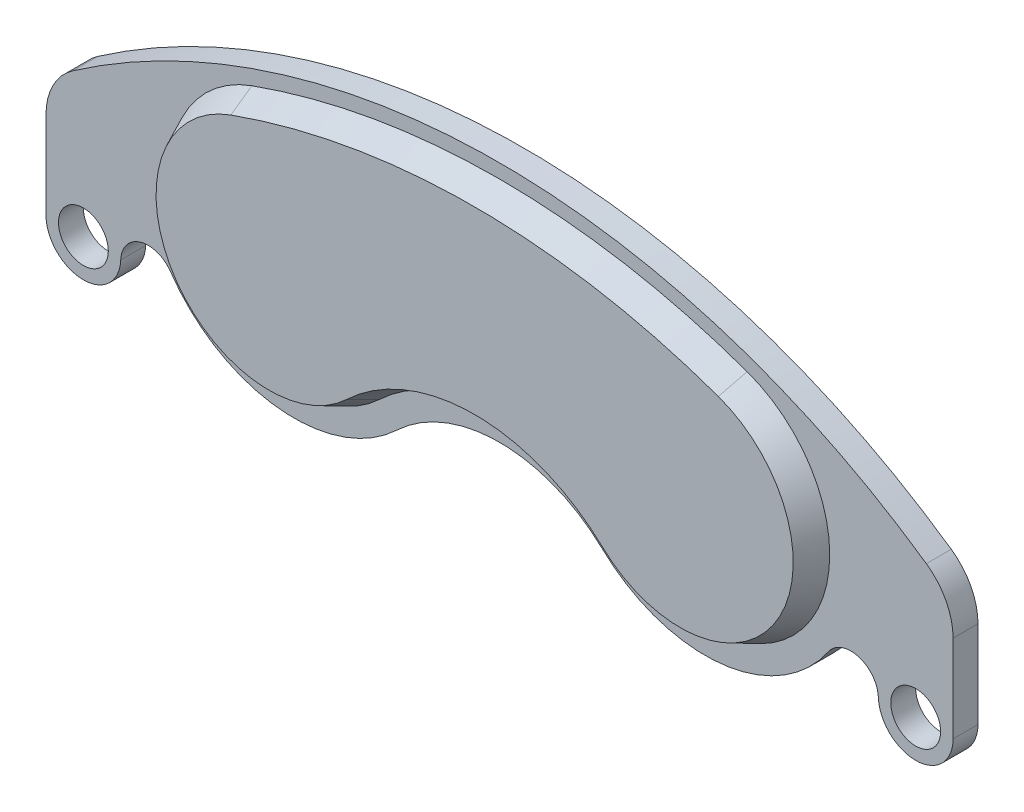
ISO-10303-21;
HEADER;
FILE_DESCRIPTION(('STEP AP214'),'2;1');
FILE_NAME('part.step','',(''),(''),'','','');
FILE_SCHEMA(('AUTOMOTIVE_DESIGN { 1 0 10303 214 1 1 1 1 }'));
ENDSEC;
DATA;
#1=APPLICATION_CONTEXT('core data for automotive mechanical design processes');
#2=APPLICATION_PROTOCOL_DEFINITION('international standard','automotive_design',2000,#1);
#3=PRODUCT_CONTEXT('',#1,'mechanical');
#4=PRODUCT('Part','Part','',(#3));
#5=PRODUCT_RELATED_PRODUCT_CATEGORY('part','',(#4));
#6=PRODUCT_DEFINITION_FORMATION('','',#4);
#7=PRODUCT_DEFINITION_CONTEXT('part definition',#1,'design');
#8=PRODUCT_DEFINITION('design','',#6,#7);
#9=PRODUCT_DEFINITION_SHAPE('','',#8);
#10=(LENGTH_UNIT() NAMED_UNIT(*) SI_UNIT(.MILLI.,.METRE.));
#11=(NAMED_UNIT(*) PLANE_ANGLE_UNIT() SI_UNIT($,.RADIAN.));
#12=(NAMED_UNIT(*) SI_UNIT($,.STERADIAN.) SOLID_ANGLE_UNIT());
#13=UNCERTAINTY_MEASURE_WITH_UNIT(LENGTH_MEASURE(1.E-05),#10,'distance_accuracy_value','');
#14=(GEOMETRIC_REPRESENTATION_CONTEXT(3) GLOBAL_UNCERTAINTY_ASSIGNED_CONTEXT((#13)) GLOBAL_UNIT_ASSIGNED_CONTEXT((#10,
#11,#12)) REPRESENTATION_CONTEXT('',''));
#15=CARTESIAN_POINT('',(0.,0.,0.));
#16=DIRECTION('',(0.,0.,1.));
#17=DIRECTION('',(1.,0.,0.));
#18=AXIS2_PLACEMENT_3D('',#15,#16,#17);
#19=CARTESIAN_POINT('',(-39.878,57.3477777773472,1.27));
#20=DIRECTION('',(0.,0.,1.));
#21=DIRECTION('',(1.,0.,0.));
#22=AXIS2_PLACEMENT_3D('',#19,#20,#21);
#23=PLANE('',#22);
#24=CARTESIAN_POINT('',(42.418,48.4577777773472,1.27));
#25=DIRECTION('',(0.,0.,1.));
#26=DIRECTION('',(1.,0.,0.));
#27=AXIS2_PLACEMENT_3D('',#24,#25,#26);
#28=CIRCLE('',#27,2.54);
#29=CARTESIAN_POINT('',(44.958,48.4577777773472,1.27));
#30=VERTEX_POINT('',#29);
#31=EDGE_CURVE('E299',#30,#30,#28,.T.);
#32=ORIENTED_EDGE('',*,*,#31,.F.);
#33=EDGE_LOOP('',(#32));
#34=FACE_BOUND('',#33,.T.);
#35=CARTESIAN_POINT('',(-42.418,48.4577777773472,1.27));
#36=DIRECTION('',(0.,0.,1.));
#37=DIRECTION('',(1.,0.,0.));
#38=AXIS2_PLACEMENT_3D('',#35,#36,#37);
#39=CIRCLE('',#38,2.54);
#40=CARTESIAN_POINT('',(-39.878,48.4577777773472,1.27));
#41=VERTEX_POINT('',#40);
#42=EDGE_CURVE('E293',#41,#41,#39,.T.);
#43=ORIENTED_EDGE('',*,*,#42,.F.);
#44=EDGE_LOOP('',(#43));
#45=FACE_BOUND('',#44,.T.);
#46=CARTESIAN_POINT('',(-39.878,57.3477777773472,1.27));
#47=DIRECTION('',(0.,0.,1.));
#48=DIRECTION('',(1.,0.,0.));
#49=AXIS2_PLACEMENT_3D('',#46,#47,#48);
#50=CIRCLE('',#49,6.34999999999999);
#51=CARTESIAN_POINT('',(-43.5032727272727,62.5612121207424,1.27));
#52=VERTEX_POINT('',#51);
#53=CARTESIAN_POINT('',(-46.228,57.3477777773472,1.27));
#54=VERTEX_POINT('',#53);
#55=EDGE_CURVE('E188',#52,#54,#50,.T.);
#56=ORIENTED_EDGE('',*,*,#55,.T.);
#57=DIRECTION('',(0.,-1.,0.));
#58=VECTOR('',#57,1.);
#59=CARTESIAN_POINT('',(-46.228,57.3477777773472,1.27));
#60=LINE('',#59,#58);
#61=CARTESIAN_POINT('',(-46.228,48.4577777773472,1.27));
#62=VERTEX_POINT('',#61);
#63=EDGE_CURVE('E109',#54,#62,#60,.T.);
#64=ORIENTED_EDGE('',*,*,#63,.T.);
#65=CARTESIAN_POINT('',(-42.418,48.4577777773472,1.27));
#66=DIRECTION('',(0.,0.,1.));
#67=DIRECTION('',(1.,0.,0.));
#68=AXIS2_PLACEMENT_3D('',#65,#66,#67);
#69=CIRCLE('',#68,3.81);
#70=CARTESIAN_POINT('',(-38.6107361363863,48.3134106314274,1.27));
#71=VERTEX_POINT('',#70);
#72=EDGE_CURVE('E215',#62,#71,#69,.T.);
#73=ORIENTED_EDGE('',*,*,#72,.T.);
#74=CARTESIAN_POINT('',(-35.8187426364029,48.2075413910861,1.27));
#75=DIRECTION('',(0.,0.,-1.));
#76=DIRECTION('',(-1.,0.,0.));
#77=AXIS2_PLACEMENT_3D('',#74,#75,#76);
#78=CIRCLE('',#77,2.794);
#79=CARTESIAN_POINT('',(-33.5159092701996,49.7897532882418,1.27));
#80=VERTEX_POINT('',#79);
#81=EDGE_CURVE('E233',#71,#80,#78,.T.);
#82=ORIENTED_EDGE('',*,*,#81,.T.);
#83=CARTESIAN_POINT('',(-20.955,58.42,1.27));
#84=DIRECTION('',(0.,0.,1.));
#85=DIRECTION('',(1.,0.,0.));
#86=AXIS2_PLACEMENT_3D('',#83,#84,#85);
#87=CIRCLE('',#86,15.24);
#88=CARTESIAN_POINT('',(-10.4775,47.3529500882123,1.27));
#89=VERTEX_POINT('',#88);
#90=EDGE_CURVE('E230',#80,#89,#87,.T.);
#91=ORIENTED_EDGE('',*,*,#90,.T.);
#92=CARTESIAN_POINT('',(0.,36.2859001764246,1.27));
#93=DIRECTION('',(0.,0.,-1.));
#94=DIRECTION('',(-1.,0.,0.));
#95=AXIS2_PLACEMENT_3D('',#92,#93,#94);
#96=CIRCLE('',#95,15.24);
#97=CARTESIAN_POINT('',(10.4775,47.3529500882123,1.27));
#98=VERTEX_POINT('',#97);
#99=EDGE_CURVE('E232',#89,#98,#96,.T.);
#100=ORIENTED_EDGE('',*,*,#99,.T.);
#101=CARTESIAN_POINT('',(20.955,58.42,1.27));
#102=DIRECTION('',(0.,0.,1.));
#103=DIRECTION('',(1.,0.,0.));
#104=AXIS2_PLACEMENT_3D('',#101,#102,#103);
#105=CIRCLE('',#104,15.24);
#106=CARTESIAN_POINT('',(33.5159092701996,49.7897532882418,1.27));
#107=VERTEX_POINT('',#106);
#108=EDGE_CURVE('E235',#98,#107,#105,.T.);
#109=ORIENTED_EDGE('',*,*,#108,.T.);
#110=CARTESIAN_POINT('',(35.8187426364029,48.2075413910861,1.27));
#111=DIRECTION('',(0.,0.,-1.));
#112=DIRECTION('',(-1.,0.,0.));
#113=AXIS2_PLACEMENT_3D('',#110,#111,#112);
#114=CIRCLE('',#113,2.794);
#115=CARTESIAN_POINT('',(38.6107361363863,48.3134106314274,1.27));
#116=VERTEX_POINT('',#115);
#117=EDGE_CURVE('E241',#107,#116,#114,.T.);
#118=ORIENTED_EDGE('',*,*,#117,.T.);
#119=CARTESIAN_POINT('',(42.418,48.4577777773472,1.27));
#120=DIRECTION('',(0.,0.,1.));
#121=DIRECTION('',(1.,0.,0.));
#122=AXIS2_PLACEMENT_3D('',#119,#120,#121);
#123=CIRCLE('',#122,3.81);
#124=CARTESIAN_POINT('',(46.228,48.4577777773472,1.27));
#125=VERTEX_POINT('',#124);
#126=EDGE_CURVE('E143',#116,#125,#123,.T.);
#127=ORIENTED_EDGE('',*,*,#126,.T.);
#128=DIRECTION('',(0.,1.,0.));
#129=VECTOR('',#128,1.);
#130=CARTESIAN_POINT('',(46.228,57.3477777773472,1.27));
#131=LINE('',#130,#129);
#132=CARTESIAN_POINT('',(46.228,57.3477777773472,1.27));
#133=VERTEX_POINT('',#132);
#134=EDGE_CURVE('E136',#125,#133,#131,.T.);
#135=ORIENTED_EDGE('',*,*,#134,.T.);
#136=CARTESIAN_POINT('',(39.878,57.3477777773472,1.27));
#137=DIRECTION('',(0.,0.,1.));
#138=DIRECTION('',(-1.,0.,0.));
#139=AXIS2_PLACEMENT_3D('',#136,#137,#138);
#140=CIRCLE('',#139,6.34999999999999);
#141=CARTESIAN_POINT('',(43.5032727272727,62.5612121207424,1.27));
#142=VERTEX_POINT('',#141);
#143=EDGE_CURVE('E140',#133,#142,#140,.T.);
#144=ORIENTED_EDGE('',*,*,#143,.T.);
#145=CARTESIAN_POINT('',(0.,0.,1.27));
#146=DIRECTION('',(0.,0.,1.));
#147=DIRECTION('',(-1.,0.,0.));
#148=AXIS2_PLACEMENT_3D('',#145,#146,#147);
#149=CIRCLE('',#148,76.2);
#150=EDGE_CURVE('E56',#142,#52,#149,.T.);
#151=ORIENTED_EDGE('',*,*,#150,.T.);
#152=EDGE_LOOP('',(#56,#64,#73,#82,#91,#100,#109,#118,#127,#135,#144,#151));
#153=FACE_BOUND('',#152,.T.);
#154=CARTESIAN_POINT('',(0.,36.2859001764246,1.27));
#155=DIRECTION('',(0.,0.,-1.));
#156=DIRECTION('',(-1.,0.,0.));
#157=AXIS2_PLACEMENT_3D('',#154,#155,#156);
#158=CIRCLE('',#157,17.78);
#159=CARTESIAN_POINT('',(-12.22375,49.1974584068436,1.27));
#160=VERTEX_POINT('',#159);
#161=CARTESIAN_POINT('',(12.22375,49.1974584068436,1.27));
#162=VERTEX_POINT('',#161);
#163=EDGE_CURVE('E284',#160,#162,#158,.T.);
#164=ORIENTED_EDGE('',*,*,#163,.F.);
#165=CARTESIAN_POINT('',(-20.955,58.42,1.27));
#166=DIRECTION('',(0.,0.,1.));
#167=DIRECTION('',(1.,0.,0.));
#168=AXIS2_PLACEMENT_3D('',#165,#166,#167);
#169=CIRCLE('',#168,12.7);
#170=CARTESIAN_POINT('',(-25.2429308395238,70.3742314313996,1.27));
#171=VERTEX_POINT('',#170);
#172=EDGE_CURVE('E287',#171,#160,#169,.T.);
#173=ORIENTED_EDGE('',*,*,#172,.F.);
#174=CARTESIAN_POINT('',(0.,0.,1.27));
#175=DIRECTION('',(0.,0.,1.));
#176=DIRECTION('',(-1.,0.,0.));
#177=AXIS2_PLACEMENT_3D('',#174,#175,#176);
#178=CIRCLE('',#177,74.7645504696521);
#179=CARTESIAN_POINT('',(25.2429308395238,70.3742314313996,1.27));
#180=VERTEX_POINT('',#179);
#181=EDGE_CURVE('E272',#180,#171,#178,.T.);
#182=ORIENTED_EDGE('',*,*,#181,.F.);
#183=CARTESIAN_POINT('',(20.955,58.42,1.27));
#184=DIRECTION('',(0.,0.,1.));
#185=DIRECTION('',(1.,0.,0.));
#186=AXIS2_PLACEMENT_3D('',#183,#184,#185);
#187=CIRCLE('',#186,12.7);
#188=EDGE_CURVE('E282',#162,#180,#187,.T.);
#189=ORIENTED_EDGE('',*,*,#188,.F.);
#190=EDGE_LOOP('',(#164,#173,#182,#189));
#191=FACE_BOUND('',#190,.T.);
#192=ADVANCED_FACE('F32',(#34,#45,#153,#191),#23,.T.);
#193=CARTESIAN_POINT('',(-39.878,57.3477777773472,1.27));
#194=DIRECTION('',(0.,0.,-1.));
#195=DIRECTION('',(-1.,0.,0.));
#196=AXIS2_PLACEMENT_3D('',#193,#194,#195);
#197=CYLINDRICAL_SURFACE('',#196,6.34999999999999);
#198=CARTESIAN_POINT('',(-39.878,57.3477777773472,-1.27));
#199=DIRECTION('',(0.,0.,1.));
#200=DIRECTION('',(1.,0.,0.));
#201=AXIS2_PLACEMENT_3D('',#198,#199,#200);
#202=CIRCLE('',#201,6.34999999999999);
#203=CARTESIAN_POINT('',(-43.5032727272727,62.5612121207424,-1.27));
#204=VERTEX_POINT('',#203);
#205=CARTESIAN_POINT('',(-46.228,57.3477777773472,-1.27));
#206=VERTEX_POINT('',#205);
#207=EDGE_CURVE('E164',#204,#206,#202,.T.);
#208=ORIENTED_EDGE('',*,*,#207,.T.);
#209=DIRECTION('',(0.,0.,-1.));
#210=VECTOR('',#209,1.);
#211=CARTESIAN_POINT('',(-46.228,57.3477777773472,1.27));
#212=LINE('',#211,#210);
#213=EDGE_CURVE('E11',#54,#206,#212,.T.);
#214=ORIENTED_EDGE('',*,*,#213,.F.);
#215=ORIENTED_EDGE('',*,*,#55,.F.);
#216=DIRECTION('',(0.,0.,-1.));
#217=VECTOR('',#216,1.);
#218=CARTESIAN_POINT('',(-43.5032727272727,62.5612121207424,1.27));
#219=LINE('',#218,#217);
#220=EDGE_CURVE('E160',#52,#204,#219,.T.);
#221=ORIENTED_EDGE('',*,*,#220,.T.);
#222=EDGE_LOOP('',(#208,#214,#215,#221));
#223=FACE_BOUND('',#222,.T.);
#224=ADVANCED_FACE('F34',(#223),#197,.T.);
#225=CARTESIAN_POINT('',(-46.228,57.3477777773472,1.27));
#226=DIRECTION('',(1.,0.,0.));
#227=DIRECTION('',(0.,0.,-1.));
#228=AXIS2_PLACEMENT_3D('',#225,#226,#227);
#229=PLANE('',#228);
#230=DIRECTION('',(0.,-1.,0.));
#231=VECTOR('',#230,1.);
#232=CARTESIAN_POINT('',(-46.228,57.3477777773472,-1.27));
#233=LINE('',#232,#231);
#234=CARTESIAN_POINT('',(-46.228,48.4577777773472,-1.27));
#235=VERTEX_POINT('',#234);
#236=EDGE_CURVE('E167',#206,#235,#233,.T.);
#237=ORIENTED_EDGE('',*,*,#236,.T.);
#238=DIRECTION('',(0.,0.,-1.));
#239=VECTOR('',#238,1.);
#240=CARTESIAN_POINT('',(-46.228,48.4577777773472,1.27));
#241=LINE('',#240,#239);
#242=EDGE_CURVE('E40',#62,#235,#241,.T.);
#243=ORIENTED_EDGE('',*,*,#242,.F.);
#244=ORIENTED_EDGE('',*,*,#63,.F.);
#245=ORIENTED_EDGE('',*,*,#213,.T.);
#246=EDGE_LOOP('',(#237,#243,#244,#245));
#247=FACE_BOUND('',#246,.T.);
#248=ADVANCED_FACE('F354',(#247),#229,.F.);
#249=CARTESIAN_POINT('',(-42.418,48.4577777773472,1.27));
#250=DIRECTION('',(0.,0.,-1.));
#251=DIRECTION('',(-1.,0.,0.));
#252=AXIS2_PLACEMENT_3D('',#249,#250,#251);
#253=CYLINDRICAL_SURFACE('',#252,3.81);
#254=CARTESIAN_POINT('',(-42.418,48.4577777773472,-1.27));
#255=DIRECTION('',(0.,0.,1.));
#256=DIRECTION('',(1.,0.,0.));
#257=AXIS2_PLACEMENT_3D('',#254,#255,#256);
#258=CIRCLE('',#257,3.81);
#259=CARTESIAN_POINT('',(-38.6107361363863,48.3134106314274,-1.27));
#260=VERTEX_POINT('',#259);
#261=EDGE_CURVE('E170',#235,#260,#258,.T.);
#262=ORIENTED_EDGE('',*,*,#261,.T.);
#263=DIRECTION('',(0.,0.,-1.));
#264=VECTOR('',#263,1.);
#265=CARTESIAN_POINT('',(-38.6107361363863,48.3134106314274,1.27));
#266=LINE('',#265,#264);
#267=EDGE_CURVE('E207',#71,#260,#266,.T.);
#268=ORIENTED_EDGE('',*,*,#267,.F.);
#269=ORIENTED_EDGE('',*,*,#72,.F.);
#270=ORIENTED_EDGE('',*,*,#242,.T.);
#271=EDGE_LOOP('',(#262,#268,#269,#270));
#272=FACE_BOUND('',#271,.T.);
#273=ADVANCED_FACE('F213',(#272),#253,.T.);
#274=CARTESIAN_POINT('',(-35.8187426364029,48.2075413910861,1.27));
#275=DIRECTION('',(0.,0.,-1.));
#276=DIRECTION('',(-1.,0.,0.));
#277=AXIS2_PLACEMENT_3D('',#274,#275,#276);
#278=CYLINDRICAL_SURFACE('',#277,2.794);
#279=CARTESIAN_POINT('',(-35.8187426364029,48.2075413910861,-1.27));
#280=DIRECTION('',(0.,0.,-1.));
#281=DIRECTION('',(-1.,0.,0.));
#282=AXIS2_PLACEMENT_3D('',#279,#280,#281);
#283=CIRCLE('',#282,2.794);
#284=CARTESIAN_POINT('',(-33.5159092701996,49.7897532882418,-1.27));
#285=VERTEX_POINT('',#284);
#286=EDGE_CURVE('E172',#260,#285,#283,.T.);
#287=ORIENTED_EDGE('',*,*,#286,.T.);
#288=DIRECTION('',(0.,0.,-1.));
#289=VECTOR('',#288,1.);
#290=CARTESIAN_POINT('',(-33.5159092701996,49.7897532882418,1.27));
#291=LINE('',#290,#289);
#292=EDGE_CURVE('E204',#80,#285,#291,.T.);
#293=ORIENTED_EDGE('',*,*,#292,.F.);
#294=ORIENTED_EDGE('',*,*,#81,.F.);
#295=ORIENTED_EDGE('',*,*,#267,.T.);
#296=EDGE_LOOP('',(#287,#293,#294,#295));
#297=FACE_BOUND('',#296,.T.);
#298=ADVANCED_FACE('F224',(#297),#278,.F.);
#299=CARTESIAN_POINT('',(-20.955,58.42,1.27));
#300=DIRECTION('',(0.,0.,-1.));
#301=DIRECTION('',(-1.,0.,0.));
#302=AXIS2_PLACEMENT_3D('',#299,#300,#301);
#303=CYLINDRICAL_SURFACE('',#302,15.24);
#304=CARTESIAN_POINT('',(-20.955,58.42,-1.27));
#305=DIRECTION('',(0.,0.,1.));
#306=DIRECTION('',(1.,0.,0.));
#307=AXIS2_PLACEMENT_3D('',#304,#305,#306);
#308=CIRCLE('',#307,15.24);
#309=CARTESIAN_POINT('',(-10.4775,47.3529500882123,-1.27));
#310=VERTEX_POINT('',#309);
#311=EDGE_CURVE('E174',#285,#310,#308,.T.);
#312=ORIENTED_EDGE('',*,*,#311,.T.);
#313=DIRECTION('',(0.,0.,-1.));
#314=VECTOR('',#313,1.);
#315=CARTESIAN_POINT('',(-10.4775,47.3529500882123,1.27));
#316=LINE('',#315,#314);
#317=EDGE_CURVE('E201',#89,#310,#316,.T.);
#318=ORIENTED_EDGE('',*,*,#317,.F.);
#319=ORIENTED_EDGE('',*,*,#90,.F.);
#320=ORIENTED_EDGE('',*,*,#292,.T.);
#321=EDGE_LOOP('',(#312,#318,#319,#320));
#322=FACE_BOUND('',#321,.T.);
#323=ADVANCED_FACE('F228',(#322),#303,.T.);
#324=CARTESIAN_POINT('',(0.,36.2859001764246,1.27));
#325=DIRECTION('',(0.,0.,-1.));
#326=DIRECTION('',(-1.,0.,0.));
#327=AXIS2_PLACEMENT_3D('',#324,#325,#326);
#328=CYLINDRICAL_SURFACE('',#327,15.24);
#329=CARTESIAN_POINT('',(0.,36.2859001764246,-1.27));
#330=DIRECTION('',(0.,0.,-1.));
#331=DIRECTION('',(-1.,0.,0.));
#332=AXIS2_PLACEMENT_3D('',#329,#330,#331);
#333=CIRCLE('',#332,15.24);
#334=CARTESIAN_POINT('',(10.4775,47.3529500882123,-1.27));
#335=VERTEX_POINT('',#334);
#336=EDGE_CURVE('E176',#310,#335,#333,.T.);
#337=ORIENTED_EDGE('',*,*,#336,.T.);
#338=DIRECTION('',(0.,0.,-1.));
#339=VECTOR('',#338,1.);
#340=CARTESIAN_POINT('',(10.4775,47.3529500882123,1.27));
#341=LINE('',#340,#339);
#342=EDGE_CURVE('E198',#98,#335,#341,.T.);
#343=ORIENTED_EDGE('',*,*,#342,.F.);
#344=ORIENTED_EDGE('',*,*,#99,.F.);
#345=ORIENTED_EDGE('',*,*,#317,.T.);
#346=EDGE_LOOP('',(#337,#343,#344,#345));
#347=FACE_BOUND('',#346,.T.);
#348=ADVANCED_FACE('F344',(#347),#328,.F.);
#349=CARTESIAN_POINT('',(20.955,58.42,1.27));
#350=DIRECTION('',(0.,0.,-1.));
#351=DIRECTION('',(-1.,0.,0.));
#352=AXIS2_PLACEMENT_3D('',#349,#350,#351);
#353=CYLINDRICAL_SURFACE('',#352,15.24);
#354=CARTESIAN_POINT('',(20.955,58.42,-1.27));
#355=DIRECTION('',(0.,0.,1.));
#356=DIRECTION('',(1.,0.,0.));
#357=AXIS2_PLACEMENT_3D('',#354,#355,#356);
#358=CIRCLE('',#357,15.24);
#359=CARTESIAN_POINT('',(33.5159092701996,49.7897532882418,-1.27));
#360=VERTEX_POINT('',#359);
#361=EDGE_CURVE('E178',#335,#360,#358,.T.);
#362=ORIENTED_EDGE('',*,*,#361,.T.);
#363=DIRECTION('',(0.,0.,-1.));
#364=VECTOR('',#363,1.);
#365=CARTESIAN_POINT('',(33.5159092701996,49.7897532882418,1.27));
#366=LINE('',#365,#364);
#367=EDGE_CURVE('E195',#107,#360,#366,.T.);
#368=ORIENTED_EDGE('',*,*,#367,.F.);
#369=ORIENTED_EDGE('',*,*,#108,.F.);
#370=ORIENTED_EDGE('',*,*,#342,.T.);
#371=EDGE_LOOP('',(#362,#368,#369,#370));
#372=FACE_BOUND('',#371,.T.);
#373=ADVANCED_FACE('F341',(#372),#353,.T.);
#374=CARTESIAN_POINT('',(35.8187426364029,48.2075413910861,1.27));
#375=DIRECTION('',(0.,0.,-1.));
#376=DIRECTION('',(-1.,0.,0.));
#377=AXIS2_PLACEMENT_3D('',#374,#375,#376);
#378=CYLINDRICAL_SURFACE('',#377,2.794);
#379=CARTESIAN_POINT('',(35.8187426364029,48.2075413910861,-1.27));
#380=DIRECTION('',(0.,0.,-1.));
#381=DIRECTION('',(-1.,0.,0.));
#382=AXIS2_PLACEMENT_3D('',#379,#380,#381);
#383=CIRCLE('',#382,2.794);
#384=CARTESIAN_POINT('',(38.6107361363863,48.3134106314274,-1.27));
#385=VERTEX_POINT('',#384);
#386=EDGE_CURVE('E180',#360,#385,#383,.T.);
#387=ORIENTED_EDGE('',*,*,#386,.T.);
#388=DIRECTION('',(0.,0.,-1.));
#389=VECTOR('',#388,1.);
#390=CARTESIAN_POINT('',(38.6107361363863,48.3134106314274,1.27));
#391=LINE('',#390,#389);
#392=EDGE_CURVE('E192',#116,#385,#391,.T.);
#393=ORIENTED_EDGE('',*,*,#392,.F.);
#394=ORIENTED_EDGE('',*,*,#117,.F.);
#395=ORIENTED_EDGE('',*,*,#367,.T.);
#396=EDGE_LOOP('',(#387,#393,#394,#395));
#397=FACE_BOUND('',#396,.T.);
#398=ADVANCED_FACE('F247',(#397),#378,.F.);
#399=CARTESIAN_POINT('',(42.418,48.4577777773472,1.27));
#400=DIRECTION('',(0.,0.,-1.));
#401=DIRECTION('',(-1.,0.,0.));
#402=AXIS2_PLACEMENT_3D('',#399,#400,#401);
#403=CYLINDRICAL_SURFACE('',#402,3.81);
#404=CARTESIAN_POINT('',(42.418,48.4577777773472,-1.27));
#405=DIRECTION('',(0.,0.,1.));
#406=DIRECTION('',(1.,0.,0.));
#407=AXIS2_PLACEMENT_3D('',#404,#405,#406);
#408=CIRCLE('',#407,3.81);
#409=CARTESIAN_POINT('',(46.228,48.4577777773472,-1.27));
#410=VERTEX_POINT('',#409);
#411=EDGE_CURVE('E182',#385,#410,#408,.T.);
#412=ORIENTED_EDGE('',*,*,#411,.T.);
#413=DIRECTION('',(0.,0.,-1.));
#414=VECTOR('',#413,1.);
#415=CARTESIAN_POINT('',(46.228,48.4577777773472,1.27));
#416=LINE('',#415,#414);
#417=EDGE_CURVE('E155',#125,#410,#416,.T.);
#418=ORIENTED_EDGE('',*,*,#417,.F.);
#419=ORIENTED_EDGE('',*,*,#126,.F.);
#420=ORIENTED_EDGE('',*,*,#392,.T.);
#421=EDGE_LOOP('',(#412,#418,#419,#420));
#422=FACE_BOUND('',#421,.T.);
#423=ADVANCED_FACE('F251',(#422),#403,.T.);
#424=CARTESIAN_POINT('',(46.228,57.3477777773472,1.27));
#425=DIRECTION('',(-1.,0.,0.));
#426=DIRECTION('',(0.,0.,1.));
#427=AXIS2_PLACEMENT_3D('',#424,#425,#426);
#428=PLANE('',#427);
#429=DIRECTION('',(0.,1.,0.));
#430=VECTOR('',#429,1.);
#431=CARTESIAN_POINT('',(46.228,57.3477777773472,-1.27));
#432=LINE('',#431,#430);
#433=CARTESIAN_POINT('',(46.228,57.3477777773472,-1.27));
#434=VERTEX_POINT('',#433);
#435=EDGE_CURVE('E152',#410,#434,#432,.T.);
#436=ORIENTED_EDGE('',*,*,#435,.T.);
#437=DIRECTION('',(0.,0.,-1.));
#438=VECTOR('',#437,1.);
#439=CARTESIAN_POINT('',(46.228,57.3477777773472,1.27));
#440=LINE('',#439,#438);
#441=EDGE_CURVE('E149',#133,#434,#440,.T.);
#442=ORIENTED_EDGE('',*,*,#441,.F.);
#443=ORIENTED_EDGE('',*,*,#134,.F.);
#444=ORIENTED_EDGE('',*,*,#417,.T.);
#445=EDGE_LOOP('',(#436,#442,#443,#444));
#446=FACE_BOUND('',#445,.T.);
#447=ADVANCED_FACE('F150',(#446),#428,.F.);
#448=CARTESIAN_POINT('',(39.878,57.3477777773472,1.27));
#449=DIRECTION('',(0.,0.,-1.));
#450=DIRECTION('',(-1.,0.,0.));
#451=AXIS2_PLACEMENT_3D('',#448,#449,#450);
#452=CYLINDRICAL_SURFACE('',#451,6.34999999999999);
#453=CARTESIAN_POINT('',(39.878,57.3477777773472,-1.27));
#454=DIRECTION('',(0.,0.,1.));
#455=DIRECTION('',(-1.,0.,0.));
#456=AXIS2_PLACEMENT_3D('',#453,#454,#455);
#457=CIRCLE('',#456,6.34999999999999);
#458=CARTESIAN_POINT('',(43.5032727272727,62.5612121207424,-1.27));
#459=VERTEX_POINT('',#458);
#460=EDGE_CURVE('E185',#434,#459,#457,.T.);
#461=ORIENTED_EDGE('',*,*,#460,.T.);
#462=DIRECTION('',(0.,0.,-1.));
#463=VECTOR('',#462,1.);
#464=CARTESIAN_POINT('',(43.5032727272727,62.5612121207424,1.27));
#465=LINE('',#464,#463);
#466=EDGE_CURVE('E156',#142,#459,#465,.T.);
#467=ORIENTED_EDGE('',*,*,#466,.F.);
#468=ORIENTED_EDGE('',*,*,#143,.F.);
#469=ORIENTED_EDGE('',*,*,#441,.T.);
#470=EDGE_LOOP('',(#461,#467,#468,#469));
#471=FACE_BOUND('',#470,.T.);
#472=ADVANCED_FACE('F158',(#471),#452,.T.);
#473=CARTESIAN_POINT('',(0.,0.,1.27));
#474=DIRECTION('',(0.,0.,-1.));
#475=DIRECTION('',(-1.,0.,0.));
#476=AXIS2_PLACEMENT_3D('',#473,#474,#475);
#477=CYLINDRICAL_SURFACE('',#476,76.2);
#478=CARTESIAN_POINT('',(0.,0.,-1.27));
#479=DIRECTION('',(0.,0.,1.));
#480=DIRECTION('',(-1.,0.,0.));
#481=AXIS2_PLACEMENT_3D('',#478,#479,#480);
#482=CIRCLE('',#481,76.2);
#483=EDGE_CURVE('E101',#459,#204,#482,.T.);
#484=ORIENTED_EDGE('',*,*,#483,.T.);
#485=ORIENTED_EDGE('',*,*,#220,.F.);
#486=ORIENTED_EDGE('',*,*,#150,.F.);
#487=ORIENTED_EDGE('',*,*,#466,.T.);
#488=EDGE_LOOP('',(#484,#485,#486,#487));
#489=FACE_BOUND('',#488,.T.);
#490=ADVANCED_FACE('F252',(#489),#477,.T.);
#491=CARTESIAN_POINT('',(-39.878,57.3477777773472,-1.27));
#492=DIRECTION('',(0.,0.,1.));
#493=DIRECTION('',(1.,0.,0.));
#494=AXIS2_PLACEMENT_3D('',#491,#492,#493);
#495=PLANE('',#494);
#496=CARTESIAN_POINT('',(42.418,48.4577777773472,-1.27));
#497=DIRECTION('',(0.,0.,1.));
#498=DIRECTION('',(1.,0.,0.));
#499=AXIS2_PLACEMENT_3D('',#496,#497,#498);
#500=CIRCLE('',#499,2.54);
#501=CARTESIAN_POINT('',(44.958,48.4577777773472,-1.27));
#502=VERTEX_POINT('',#501);
#503=EDGE_CURVE('E296',#502,#502,#500,.F.);
#504=ORIENTED_EDGE('',*,*,#503,.F.);
#505=EDGE_LOOP('',(#504));
#506=FACE_BOUND('',#505,.T.);
#507=CARTESIAN_POINT('',(-42.418,48.4577777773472,-1.27));
#508=DIRECTION('',(0.,0.,1.));
#509=DIRECTION('',(1.,0.,0.));
#510=AXIS2_PLACEMENT_3D('',#507,#508,#509);
#511=CIRCLE('',#510,2.54);
#512=CARTESIAN_POINT('',(-39.878,48.4577777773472,-1.27));
#513=VERTEX_POINT('',#512);
#514=EDGE_CURVE('E290',#513,#513,#511,.F.);
#515=ORIENTED_EDGE('',*,*,#514,.F.);
#516=EDGE_LOOP('',(#515));
#517=FACE_BOUND('',#516,.T.);
#518=ORIENTED_EDGE('',*,*,#207,.F.);
#519=ORIENTED_EDGE('',*,*,#483,.F.);
#520=ORIENTED_EDGE('',*,*,#460,.F.);
#521=ORIENTED_EDGE('',*,*,#435,.F.);
#522=ORIENTED_EDGE('',*,*,#411,.F.);
#523=ORIENTED_EDGE('',*,*,#386,.F.);
#524=ORIENTED_EDGE('',*,*,#361,.F.);
#525=ORIENTED_EDGE('',*,*,#336,.F.);
#526=ORIENTED_EDGE('',*,*,#311,.F.);
#527=ORIENTED_EDGE('',*,*,#286,.F.);
#528=ORIENTED_EDGE('',*,*,#261,.F.);
#529=ORIENTED_EDGE('',*,*,#236,.F.);
#530=EDGE_LOOP('',(#518,#519,#520,#521,#522,#523,#524,#525,#526,#527,#528,#529));
#531=FACE_BOUND('',#530,.T.);
#532=ADVANCED_FACE('F219',(#506,#517,#531),#495,.F.);
#533=CARTESIAN_POINT('',(-20.955,58.42,1.27));
#534=DIRECTION('',(0.,0.,-1.));
#535=DIRECTION('',(1.,0.,0.));
#536=AXIS2_PLACEMENT_3D('',#533,#534,#535);
#537=CONICAL_SURFACE('',#536,12.7,0.436332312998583);
#538=ORIENTED_EDGE('',*,*,#172,.T.);
#539=DIRECTION('',(0.290550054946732,-0.306898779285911,-0.90630778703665));
#540=VECTOR('',#539,1.);
#541=CARTESIAN_POINT('',(-12.22375,49.1974584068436,1.27));
#542=LINE('',#541,#540);
#543=CARTESIAN_POINT('',(-13.0380397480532,50.0575667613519,3.81));
#544=VERTEX_POINT('',#543);
#545=EDGE_CURVE('E168',#544,#160,#542,.T.);
#546=ORIENTED_EDGE('',*,*,#545,.F.);
#547=CARTESIAN_POINT('',(-20.955,58.42,3.81));
#548=DIRECTION('',(0.,0.,1.));
#549=DIRECTION('',(1.,0.,0.));
#550=AXIS2_PLACEMENT_3D('',#547,#548,#549);
#551=CIRCLE('',#550,11.5155785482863);
#552=CARTESIAN_POINT('',(-24.843031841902,69.2593614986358,3.81));
#553=VERTEX_POINT('',#552);
#554=EDGE_CURVE('E269',#553,#544,#551,.T.);
#555=ORIENTED_EDGE('',*,*,#554,.F.);
#556=DIRECTION('',(-0.142689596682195,0.39780129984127,-0.90630778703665));
#557=VECTOR('',#556,1.);
#558=CARTESIAN_POINT('',(-25.2429308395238,70.3742314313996,1.27));
#559=LINE('',#558,#557);
#560=EDGE_CURVE('E262',#553,#171,#559,.T.);
#561=ORIENTED_EDGE('',*,*,#560,.T.);
#562=EDGE_LOOP('',(#538,#546,#555,#561));
#563=FACE_BOUND('',#562,.T.);
#564=ADVANCED_FACE('F319',(#563),#537,.T.);
#565=CARTESIAN_POINT('',(0.,36.2859001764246,1.27));
#566=DIRECTION('',(0.,0.,1.));
#567=DIRECTION('',(-1.,0.,0.));
#568=AXIS2_PLACEMENT_3D('',#565,#566,#567);
#569=CONICAL_SURFACE('',#568,17.78,0.436332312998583);
#570=ORIENTED_EDGE('',*,*,#163,.T.);
#571=DIRECTION('',(-0.290550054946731,-0.306898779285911,-0.90630778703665));
#572=VECTOR('',#571,1.);
#573=CARTESIAN_POINT('',(12.22375,49.1974584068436,1.27));
#574=LINE('',#573,#572);
#575=CARTESIAN_POINT('',(13.0380397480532,50.0575667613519,3.81));
#576=VERTEX_POINT('',#575);
#577=EDGE_CURVE('E273',#576,#162,#574,.T.);
#578=ORIENTED_EDGE('',*,*,#577,.F.);
#579=CARTESIAN_POINT('',(0.,36.2859001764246,3.81));
#580=DIRECTION('',(0.,0.,1.));
#581=DIRECTION('',(1.,0.,0.));
#582=AXIS2_PLACEMENT_3D('',#579,#580,#581);
#583=CIRCLE('',#582,18.9644214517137);
#584=EDGE_CURVE('E266',#544,#576,#583,.F.);
#585=ORIENTED_EDGE('',*,*,#584,.F.);
#586=ORIENTED_EDGE('',*,*,#545,.T.);
#587=EDGE_LOOP('',(#570,#578,#585,#586));
#588=FACE_BOUND('',#587,.T.);
#589=ADVANCED_FACE('F326',(#588),#569,.F.);
#590=CARTESIAN_POINT('',(20.955,58.42,1.27));
#591=DIRECTION('',(0.,0.,-1.));
#592=DIRECTION('',(1.,0.,0.));
#593=AXIS2_PLACEMENT_3D('',#590,#591,#592);
#594=CONICAL_SURFACE('',#593,12.7,0.436332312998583);
#595=ORIENTED_EDGE('',*,*,#188,.T.);
#596=DIRECTION('',(0.142689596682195,0.39780129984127,-0.90630778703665));
#597=VECTOR('',#596,1.);
#598=CARTESIAN_POINT('',(25.2429308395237,70.3742314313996,1.27));
#599=LINE('',#598,#597);
#600=CARTESIAN_POINT('',(24.843031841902,69.2593614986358,3.81));
#601=VERTEX_POINT('',#600);
#602=EDGE_CURVE('E47',#601,#180,#599,.T.);
#603=ORIENTED_EDGE('',*,*,#602,.F.);
#604=CARTESIAN_POINT('',(20.955,58.42,3.81));
#605=DIRECTION('',(0.,0.,1.));
#606=DIRECTION('',(1.,0.,0.));
#607=AXIS2_PLACEMENT_3D('',#604,#605,#606);
#608=CIRCLE('',#607,11.5155785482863);
#609=EDGE_CURVE('E263',#576,#601,#608,.T.);
#610=ORIENTED_EDGE('',*,*,#609,.F.);
#611=ORIENTED_EDGE('',*,*,#577,.T.);
#612=EDGE_LOOP('',(#595,#603,#610,#611));
#613=FACE_BOUND('',#612,.T.);
#614=ADVANCED_FACE('F400',(#613),#594,.T.);
#615=CARTESIAN_POINT('',(0.,0.,1.27));
#616=DIRECTION('',(0.,0.,-1.));
#617=DIRECTION('',(-1.,0.,0.));
#618=AXIS2_PLACEMENT_3D('',#615,#616,#617);
#619=CONICAL_SURFACE('',#618,74.7645504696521,0.436332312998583);
#620=ORIENTED_EDGE('',*,*,#181,.T.);
#621=ORIENTED_EDGE('',*,*,#560,.F.);
#622=CARTESIAN_POINT('',(0.,0.,3.81));
#623=DIRECTION('',(0.,0.,1.));
#624=DIRECTION('',(1.,0.,0.));
#625=AXIS2_PLACEMENT_3D('',#622,#623,#624);
#626=CIRCLE('',#625,73.5801290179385);
#627=EDGE_CURVE('E259',#601,#553,#626,.T.);
#628=ORIENTED_EDGE('',*,*,#627,.F.);
#629=ORIENTED_EDGE('',*,*,#602,.T.);
#630=EDGE_LOOP('',(#620,#621,#628,#629));
#631=FACE_BOUND('',#630,.T.);
#632=ADVANCED_FACE('F395',(#631),#619,.T.);
#633=CARTESIAN_POINT('',(-10.4775,47.3529500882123,3.81));
#634=DIRECTION('',(0.,0.,1.));
#635=DIRECTION('',(1.,0.,0.));
#636=AXIS2_PLACEMENT_3D('',#633,#634,#635);
#637=PLANE('',#636);
#638=ORIENTED_EDGE('',*,*,#554,.T.);
#639=ORIENTED_EDGE('',*,*,#584,.T.);
#640=ORIENTED_EDGE('',*,*,#609,.T.);
#641=ORIENTED_EDGE('',*,*,#627,.T.);
#642=EDGE_LOOP('',(#638,#639,#640,#641));
#643=FACE_BOUND('',#642,.T.);
#644=ADVANCED_FACE('F314',(#643),#637,.T.);
#645=CARTESIAN_POINT('',(-42.418,48.4577777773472,-1.271));
#646=DIRECTION('',(0.,0.,1.));
#647=DIRECTION('',(1.,0.,0.));
#648=AXIS2_PLACEMENT_3D('',#645,#646,#647);
#649=CYLINDRICAL_SURFACE('',#648,2.54);
#650=ORIENTED_EDGE('',*,*,#42,.T.);
#651=EDGE_LOOP('',(#650));
#652=FACE_BOUND('',#651,.T.);
#653=ORIENTED_EDGE('',*,*,#514,.T.);
#654=EDGE_LOOP('',(#653));
#655=FACE_BOUND('',#654,.T.);
#656=ADVANCED_FACE('F311',(#652,#655),#649,.F.);
#657=CARTESIAN_POINT('',(42.418,48.4577777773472,-1.271));
#658=DIRECTION('',(0.,0.,1.));
#659=DIRECTION('',(1.,0.,0.));
#660=AXIS2_PLACEMENT_3D('',#657,#658,#659);
#661=CYLINDRICAL_SURFACE('',#660,2.54);
#662=ORIENTED_EDGE('',*,*,#31,.T.);
#663=EDGE_LOOP('',(#662));
#664=FACE_BOUND('',#663,.T.);
#665=ORIENTED_EDGE('',*,*,#503,.T.);
#666=EDGE_LOOP('',(#665));
#667=FACE_BOUND('',#666,.T.);
#668=ADVANCED_FACE('F303',(#664,#667),#661,.F.);
#669=CLOSED_SHELL('',(#192,#224,#248,#273,#298,#323,#348,#373,#398,#423,#447,#472,#490,#532,
#564,#589,#614,#632,#644,#656,#668));
#670=MANIFOLD_SOLID_BREP('B2',#669);
#671=ADVANCED_BREP_SHAPE_REPRESENTATION('',(#18,#670),#14);
#672=SHAPE_DEFINITION_REPRESENTATION(#9,#671);
ENDSEC;
END-ISO-10303-21;
